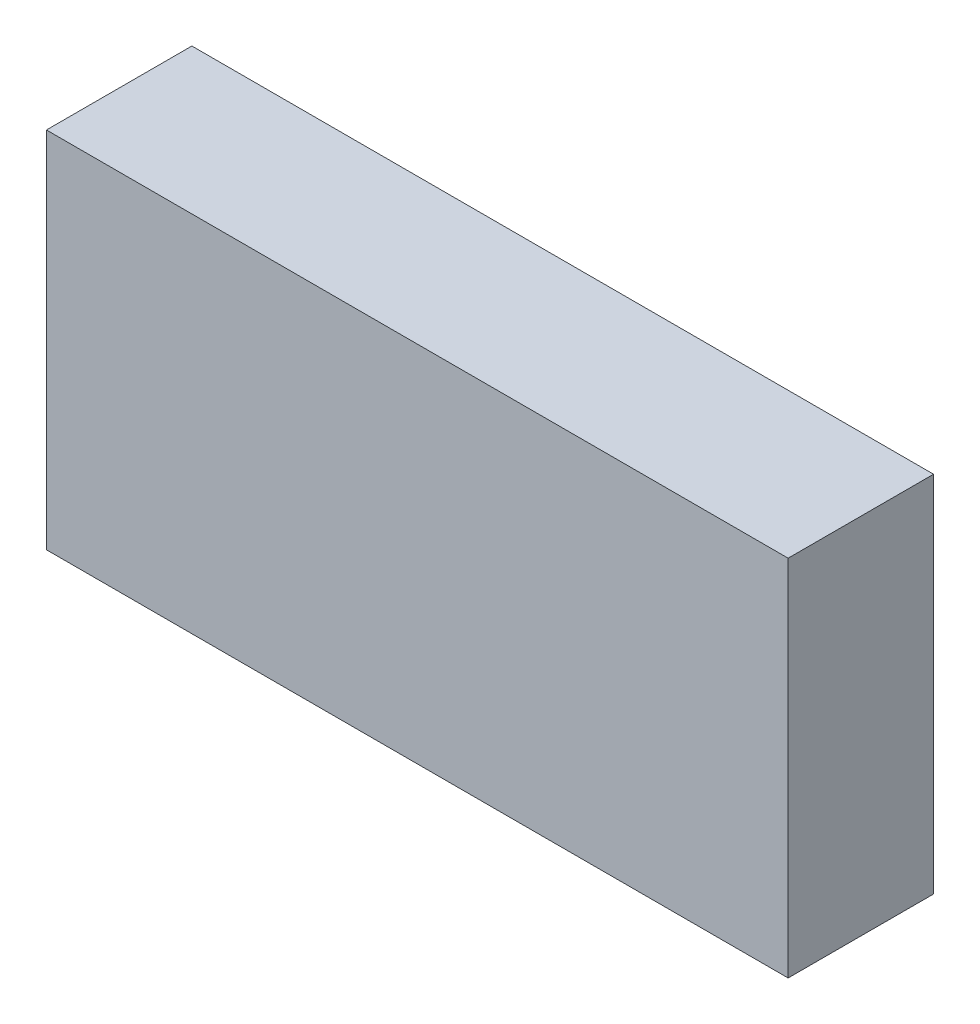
ISO-10303-21;
HEADER;
FILE_DESCRIPTION(('STEP AP214'),'2;1');
FILE_NAME('part.step','',(''),(''),'','','');
FILE_SCHEMA(('AUTOMOTIVE_DESIGN { 1 0 10303 214 1 1 1 1 }'));
ENDSEC;
DATA;
#1=APPLICATION_CONTEXT('core data for automotive mechanical design processes');
#2=APPLICATION_PROTOCOL_DEFINITION('international standard','automotive_design',2000,#1);
#3=PRODUCT_CONTEXT('',#1,'mechanical');
#4=PRODUCT('Part','Part','',(#3));
#5=PRODUCT_RELATED_PRODUCT_CATEGORY('part','',(#4));
#6=PRODUCT_DEFINITION_FORMATION('','',#4);
#7=PRODUCT_DEFINITION_CONTEXT('part definition',#1,'design');
#8=PRODUCT_DEFINITION('design','',#6,#7);
#9=PRODUCT_DEFINITION_SHAPE('','',#8);
#10=(LENGTH_UNIT() NAMED_UNIT(*) SI_UNIT(.MILLI.,.METRE.));
#11=(NAMED_UNIT(*) PLANE_ANGLE_UNIT() SI_UNIT($,.RADIAN.));
#12=(NAMED_UNIT(*) SI_UNIT($,.STERADIAN.) SOLID_ANGLE_UNIT());
#13=UNCERTAINTY_MEASURE_WITH_UNIT(LENGTH_MEASURE(1.E-05),#10,'distance_accuracy_value','');
#14=(GEOMETRIC_REPRESENTATION_CONTEXT(3) GLOBAL_UNCERTAINTY_ASSIGNED_CONTEXT((#13)) GLOBAL_UNIT_ASSIGNED_CONTEXT((#10,
#11,#12)) REPRESENTATION_CONTEXT('',''));
#15=CARTESIAN_POINT('',(0.,0.,0.));
#16=DIRECTION('',(0.,0.,1.));
#17=DIRECTION('',(1.,0.,0.));
#18=AXIS2_PLACEMENT_3D('',#15,#16,#17);
#19=CARTESIAN_POINT('',(-25.5,-12.5,6.5));
#20=DIRECTION('',(1.,0.,0.));
#21=DIRECTION('',(0.,1.,0.));
#22=AXIS2_PLACEMENT_3D('',#19,#20,#21);
#23=PLANE('',#22);
#24=DIRECTION('',(0.,0.,1.));
#25=VECTOR('',#24,1.);
#26=CARTESIAN_POINT('',(-25.5,-9.75,-8.2));
#27=LINE('',#26,#25);
#28=CARTESIAN_POINT('',(-25.5,-9.75,-8.2));
#29=VERTEX_POINT('',#28);
#30=CARTESIAN_POINT('',(-25.5,-9.75,-1.5));
#31=VERTEX_POINT('',#30);
#32=EDGE_CURVE('E153',#29,#31,#27,.T.);
#33=ORIENTED_EDGE('',*,*,#32,.F.);
#34=DIRECTION('',(0.,-1.,0.));
#35=VECTOR('',#34,1.);
#36=CARTESIAN_POINT('',(-25.5,9.75,-8.2));
#37=LINE('',#36,#35);
#38=CARTESIAN_POINT('',(-25.5,9.75,-8.2));
#39=VERTEX_POINT('',#38);
#40=EDGE_CURVE('E54',#39,#29,#37,.T.);
#41=ORIENTED_EDGE('',*,*,#40,.F.);
#42=DIRECTION('',(0.,0.,-1.));
#43=VECTOR('',#42,1.);
#44=CARTESIAN_POINT('',(-25.5,9.75,-8.2));
#45=LINE('',#44,#43);
#46=CARTESIAN_POINT('',(-25.5,9.75,-1.5));
#47=VERTEX_POINT('',#46);
#48=EDGE_CURVE('E146',#47,#39,#45,.T.);
#49=ORIENTED_EDGE('',*,*,#48,.F.);
#50=DIRECTION('',(0.,1.,0.));
#51=VECTOR('',#50,1.);
#52=CARTESIAN_POINT('',(-25.5,9.75,-1.5));
#53=LINE('',#52,#51);
#54=EDGE_CURVE('E150',#31,#47,#53,.T.);
#55=ORIENTED_EDGE('',*,*,#54,.F.);
#56=EDGE_LOOP('',(#33,#41,#49,#55));
#57=FACE_BOUND('',#56,.T.);
#58=DIRECTION('',(0.,0.,-1.));
#59=VECTOR('',#58,1.);
#60=CARTESIAN_POINT('',(-25.5,-12.5,6.5));
#61=LINE('',#60,#59);
#62=CARTESIAN_POINT('',(-25.5,-12.5,0.));
#63=VERTEX_POINT('',#62);
#64=CARTESIAN_POINT('',(-25.5,-12.5,-10.));
#65=VERTEX_POINT('',#64);
#66=EDGE_CURVE('E11',#63,#65,#61,.T.);
#67=ORIENTED_EDGE('',*,*,#66,.F.);
#68=DIRECTION('',(0.,1.,0.));
#69=VECTOR('',#68,1.);
#70=CARTESIAN_POINT('',(-25.5,12.5,0.));
#71=LINE('',#70,#69);
#72=CARTESIAN_POINT('',(-25.5,12.5,0.));
#73=VERTEX_POINT('',#72);
#74=EDGE_CURVE('E111',#63,#73,#71,.T.);
#75=ORIENTED_EDGE('',*,*,#74,.T.);
#76=DIRECTION('',(0.,0.,-1.));
#77=VECTOR('',#76,1.);
#78=CARTESIAN_POINT('',(-25.5,12.5,6.5));
#79=LINE('',#78,#77);
#80=CARTESIAN_POINT('',(-25.5,12.5,-10.));
#81=VERTEX_POINT('',#80);
#82=EDGE_CURVE('E125',#73,#81,#79,.T.);
#83=ORIENTED_EDGE('',*,*,#82,.T.);
#84=DIRECTION('',(0.,1.,0.));
#85=VECTOR('',#84,1.);
#86=CARTESIAN_POINT('',(-25.5,12.5,-10.));
#87=LINE('',#86,#85);
#88=EDGE_CURVE('E133',#65,#81,#87,.T.);
#89=ORIENTED_EDGE('',*,*,#88,.F.);
#90=EDGE_LOOP('',(#67,#75,#83,#89));
#91=FACE_BOUND('',#90,.T.);
#92=ADVANCED_FACE('F40',(#57,#91),#23,.F.);
#93=CARTESIAN_POINT('',(25.5,-12.5,6.5));
#94=DIRECTION('',(0.,1.,0.));
#95=DIRECTION('',(-1.,0.,0.));
#96=AXIS2_PLACEMENT_3D('',#93,#94,#95);
#97=PLANE('',#96);
#98=DIRECTION('',(0.,0.,-1.));
#99=VECTOR('',#98,1.);
#100=CARTESIAN_POINT('',(25.5,-12.5,6.5));
#101=LINE('',#100,#99);
#102=CARTESIAN_POINT('',(25.5,-12.5,0.));
#103=VERTEX_POINT('',#102);
#104=CARTESIAN_POINT('',(25.5,-12.5,-10.));
#105=VERTEX_POINT('',#104);
#106=EDGE_CURVE('E47',#103,#105,#101,.T.);
#107=ORIENTED_EDGE('',*,*,#106,.F.);
#108=DIRECTION('',(1.,0.,0.));
#109=VECTOR('',#108,1.);
#110=CARTESIAN_POINT('',(-25.5,-12.5,0.));
#111=LINE('',#110,#109);
#112=EDGE_CURVE('E115',#63,#103,#111,.T.);
#113=ORIENTED_EDGE('',*,*,#112,.F.);
#114=ORIENTED_EDGE('',*,*,#66,.T.);
#115=DIRECTION('',(-1.,0.,0.));
#116=VECTOR('',#115,1.);
#117=CARTESIAN_POINT('',(25.5,-12.5,-10.));
#118=LINE('',#117,#116);
#119=EDGE_CURVE('E123',#105,#65,#118,.T.);
#120=ORIENTED_EDGE('',*,*,#119,.F.);
#121=EDGE_LOOP('',(#107,#113,#114,#120));
#122=FACE_BOUND('',#121,.T.);
#123=ADVANCED_FACE('F121',(#122),#97,.F.);
#124=CARTESIAN_POINT('',(25.5,-12.5,6.5));
#125=DIRECTION('',(-1.,0.,0.));
#126=DIRECTION('',(0.,-1.,0.));
#127=AXIS2_PLACEMENT_3D('',#124,#125,#126);
#128=PLANE('',#127);
#129=DIRECTION('',(0.,0.,-1.));
#130=VECTOR('',#129,1.);
#131=CARTESIAN_POINT('',(25.5,12.5,6.5));
#132=LINE('',#131,#130);
#133=CARTESIAN_POINT('',(25.5,12.5,0.));
#134=VERTEX_POINT('',#133);
#135=CARTESIAN_POINT('',(25.5,12.5,-10.));
#136=VERTEX_POINT('',#135);
#137=EDGE_CURVE('E62',#134,#136,#132,.T.);
#138=ORIENTED_EDGE('',*,*,#137,.F.);
#139=DIRECTION('',(0.,-1.,0.));
#140=VECTOR('',#139,1.);
#141=CARTESIAN_POINT('',(25.5,12.5,0.));
#142=LINE('',#141,#140);
#143=EDGE_CURVE('E103',#134,#103,#142,.T.);
#144=ORIENTED_EDGE('',*,*,#143,.T.);
#145=ORIENTED_EDGE('',*,*,#106,.T.);
#146=DIRECTION('',(0.,-1.,0.));
#147=VECTOR('',#146,1.);
#148=CARTESIAN_POINT('',(25.5,12.5,-10.));
#149=LINE('',#148,#147);
#150=EDGE_CURVE('E130',#136,#105,#149,.T.);
#151=ORIENTED_EDGE('',*,*,#150,.F.);
#152=EDGE_LOOP('',(#138,#144,#145,#151));
#153=FACE_BOUND('',#152,.T.);
#154=ADVANCED_FACE('F105',(#153),#128,.F.);
#155=CARTESIAN_POINT('',(25.5,12.5,6.5));
#156=DIRECTION('',(0.,-1.,0.));
#157=DIRECTION('',(1.,0.,0.));
#158=AXIS2_PLACEMENT_3D('',#155,#156,#157);
#159=PLANE('',#158);
#160=ORIENTED_EDGE('',*,*,#82,.F.);
#161=DIRECTION('',(-1.,0.,0.));
#162=VECTOR('',#161,1.);
#163=CARTESIAN_POINT('',(-25.5,12.5,0.));
#164=LINE('',#163,#162);
#165=EDGE_CURVE('E119',#134,#73,#164,.T.);
#166=ORIENTED_EDGE('',*,*,#165,.F.);
#167=ORIENTED_EDGE('',*,*,#137,.T.);
#168=DIRECTION('',(1.,0.,0.));
#169=VECTOR('',#168,1.);
#170=CARTESIAN_POINT('',(25.5,12.5,-10.));
#171=LINE('',#170,#169);
#172=EDGE_CURVE('E129',#81,#136,#171,.T.);
#173=ORIENTED_EDGE('',*,*,#172,.F.);
#174=EDGE_LOOP('',(#160,#166,#167,#173));
#175=FACE_BOUND('',#174,.T.);
#176=ADVANCED_FACE('F168',(#175),#159,.F.);
#177=CARTESIAN_POINT('',(0.,0.,0.));
#178=DIRECTION('',(0.,0.,-1.));
#179=DIRECTION('',(-1.,0.,0.));
#180=AXIS2_PLACEMENT_3D('',#177,#178,#179);
#181=PLANE('',#180);
#182=ORIENTED_EDGE('',*,*,#74,.F.);
#183=ORIENTED_EDGE('',*,*,#112,.T.);
#184=ORIENTED_EDGE('',*,*,#143,.F.);
#185=ORIENTED_EDGE('',*,*,#165,.T.);
#186=EDGE_LOOP('',(#182,#183,#184,#185));
#187=FACE_BOUND('',#186,.T.);
#188=ADVANCED_FACE('F116',(#187),#181,.F.);
#189=CARTESIAN_POINT('',(0.,0.,-10.));
#190=DIRECTION('',(0.,0.,-1.));
#191=DIRECTION('',(-1.,0.,0.));
#192=AXIS2_PLACEMENT_3D('',#189,#190,#191);
#193=PLANE('',#192);
#194=ORIENTED_EDGE('',*,*,#150,.T.);
#195=ORIENTED_EDGE('',*,*,#119,.T.);
#196=ORIENTED_EDGE('',*,*,#88,.T.);
#197=ORIENTED_EDGE('',*,*,#172,.T.);
#198=EDGE_LOOP('',(#194,#195,#196,#197));
#199=FACE_BOUND('',#198,.T.);
#200=ADVANCED_FACE('F172',(#199),#193,.T.);
#201=CARTESIAN_POINT('',(12.5,9.75,-8.2));
#202=DIRECTION('',(0.,0.,-1.));
#203=DIRECTION('',(0.,1.,0.));
#204=AXIS2_PLACEMENT_3D('',#201,#202,#203);
#205=PLANE('',#204);
#206=ORIENTED_EDGE('',*,*,#40,.T.);
#207=DIRECTION('',(-1.,0.,0.));
#208=VECTOR('',#207,1.);
#209=CARTESIAN_POINT('',(12.5,-9.75,-8.2));
#210=LINE('',#209,#208);
#211=CARTESIAN_POINT('',(12.5,-9.75,-8.2));
#212=VERTEX_POINT('',#211);
#213=EDGE_CURVE('E138',#212,#29,#210,.T.);
#214=ORIENTED_EDGE('',*,*,#213,.F.);
#215=DIRECTION('',(0.,-1.,0.));
#216=VECTOR('',#215,1.);
#217=CARTESIAN_POINT('',(12.5,9.75,-8.2));
#218=LINE('',#217,#216);
#219=CARTESIAN_POINT('',(12.5,9.75,-8.2));
#220=VERTEX_POINT('',#219);
#221=EDGE_CURVE('E149',#220,#212,#218,.T.);
#222=ORIENTED_EDGE('',*,*,#221,.F.);
#223=DIRECTION('',(-1.,0.,0.));
#224=VECTOR('',#223,1.);
#225=CARTESIAN_POINT('',(12.5,9.75,-8.2));
#226=LINE('',#225,#224);
#227=EDGE_CURVE('E112',#220,#39,#226,.T.);
#228=ORIENTED_EDGE('',*,*,#227,.T.);
#229=EDGE_LOOP('',(#206,#214,#222,#228));
#230=FACE_BOUND('',#229,.T.);
#231=ADVANCED_FACE('F174',(#230),#205,.F.);
#232=CARTESIAN_POINT('',(12.5,9.75,-8.2));
#233=DIRECTION('',(0.,1.,0.));
#234=DIRECTION('',(-1.,0.,0.));
#235=AXIS2_PLACEMENT_3D('',#232,#233,#234);
#236=PLANE('',#235);
#237=ORIENTED_EDGE('',*,*,#48,.T.);
#238=ORIENTED_EDGE('',*,*,#227,.F.);
#239=DIRECTION('',(0.,0.,-1.));
#240=VECTOR('',#239,1.);
#241=CARTESIAN_POINT('',(12.5,9.75,-8.2));
#242=LINE('',#241,#240);
#243=CARTESIAN_POINT('',(12.5,9.75,-1.5));
#244=VERTEX_POINT('',#243);
#245=EDGE_CURVE('E141',#244,#220,#242,.T.);
#246=ORIENTED_EDGE('',*,*,#245,.F.);
#247=DIRECTION('',(-1.,0.,0.));
#248=VECTOR('',#247,1.);
#249=CARTESIAN_POINT('',(12.5,9.75,-1.5));
#250=LINE('',#249,#248);
#251=EDGE_CURVE('E143',#244,#47,#250,.T.);
#252=ORIENTED_EDGE('',*,*,#251,.T.);
#253=EDGE_LOOP('',(#237,#238,#246,#252));
#254=FACE_BOUND('',#253,.T.);
#255=ADVANCED_FACE('F179',(#254),#236,.F.);
#256=CARTESIAN_POINT('',(12.5,9.75,-1.5));
#257=DIRECTION('',(0.,0.,1.));
#258=DIRECTION('',(0.,-1.,0.));
#259=AXIS2_PLACEMENT_3D('',#256,#257,#258);
#260=PLANE('',#259);
#261=ORIENTED_EDGE('',*,*,#54,.T.);
#262=ORIENTED_EDGE('',*,*,#251,.F.);
#263=DIRECTION('',(0.,1.,0.));
#264=VECTOR('',#263,1.);
#265=CARTESIAN_POINT('',(12.5,9.75,-1.5));
#266=LINE('',#265,#264);
#267=CARTESIAN_POINT('',(12.5,-9.75,-1.5));
#268=VERTEX_POINT('',#267);
#269=EDGE_CURVE('E159',#268,#244,#266,.T.);
#270=ORIENTED_EDGE('',*,*,#269,.F.);
#271=DIRECTION('',(-1.,0.,0.));
#272=VECTOR('',#271,1.);
#273=CARTESIAN_POINT('',(12.5,-9.75,-1.5));
#274=LINE('',#273,#272);
#275=EDGE_CURVE('E140',#268,#31,#274,.T.);
#276=ORIENTED_EDGE('',*,*,#275,.T.);
#277=EDGE_LOOP('',(#261,#262,#270,#276));
#278=FACE_BOUND('',#277,.T.);
#279=ADVANCED_FACE('F202',(#278),#260,.F.);
#280=CARTESIAN_POINT('',(12.5,-9.75,-8.2));
#281=DIRECTION('',(0.,-1.,0.));
#282=DIRECTION('',(1.,0.,0.));
#283=AXIS2_PLACEMENT_3D('',#280,#281,#282);
#284=PLANE('',#283);
#285=ORIENTED_EDGE('',*,*,#32,.T.);
#286=ORIENTED_EDGE('',*,*,#275,.F.);
#287=DIRECTION('',(0.,0.,1.));
#288=VECTOR('',#287,1.);
#289=CARTESIAN_POINT('',(12.5,-9.75,-8.2));
#290=LINE('',#289,#288);
#291=EDGE_CURVE('E162',#212,#268,#290,.T.);
#292=ORIENTED_EDGE('',*,*,#291,.F.);
#293=ORIENTED_EDGE('',*,*,#213,.T.);
#294=EDGE_LOOP('',(#285,#286,#292,#293));
#295=FACE_BOUND('',#294,.T.);
#296=ADVANCED_FACE('F193',(#295),#284,.F.);
#297=CARTESIAN_POINT('',(12.5,0.,0.));
#298=DIRECTION('',(-1.,0.,0.));
#299=DIRECTION('',(0.,0.,1.));
#300=AXIS2_PLACEMENT_3D('',#297,#298,#299);
#301=PLANE('',#300);
#302=ORIENTED_EDGE('',*,*,#221,.T.);
#303=ORIENTED_EDGE('',*,*,#291,.T.);
#304=ORIENTED_EDGE('',*,*,#269,.T.);
#305=ORIENTED_EDGE('',*,*,#245,.T.);
#306=EDGE_LOOP('',(#302,#303,#304,#305));
#307=FACE_BOUND('',#306,.T.);
#308=ADVANCED_FACE('F199',(#307),#301,.T.);
#309=CLOSED_SHELL('',(#92,#123,#154,#176,#188,#200,#231,#255,#279,#296,#308));
#310=MANIFOLD_SOLID_BREP('B2',#309);
#311=ADVANCED_BREP_SHAPE_REPRESENTATION('',(#18,#310),#14);
#312=SHAPE_DEFINITION_REPRESENTATION(#9,#311);
ENDSEC;
END-ISO-10303-21;
